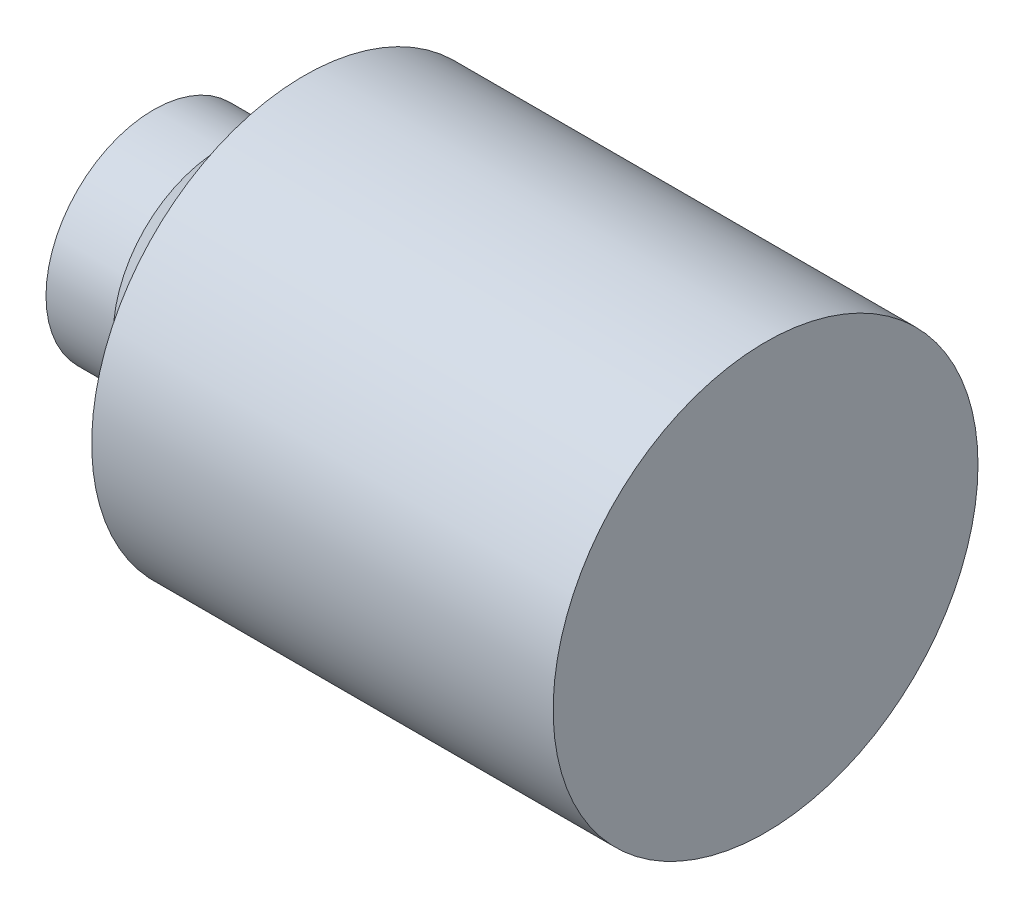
from build123d import *


with BuildPart() as part:
    # Sketch2 → Revolve2 (revolve)
    with BuildSketch(Plane.XY, mode=Mode.PRIVATE) as revolve2_sk:
        Polygon((52.823861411, 12.0396), (52.823861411, 0), (50.241540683, 0), (50.241540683, 11), (34.241540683, 11), (34.241540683, 5.517777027), (26.241540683, 5.517777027), (26.241540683, 3.96875), (18.1356, 3.96875), (18.1356, 6.096), (21.9456, 6.096), (26.67, 10.8204), (26.67, 12.0396), align=None)
    revolve(revolve2_sk.sketch.rotate(Axis((0, 0, 0), (-1, 0, 0)), 90), axis=Axis((0, 0, 0), (-1, 0, 0)))


solid = part.part
